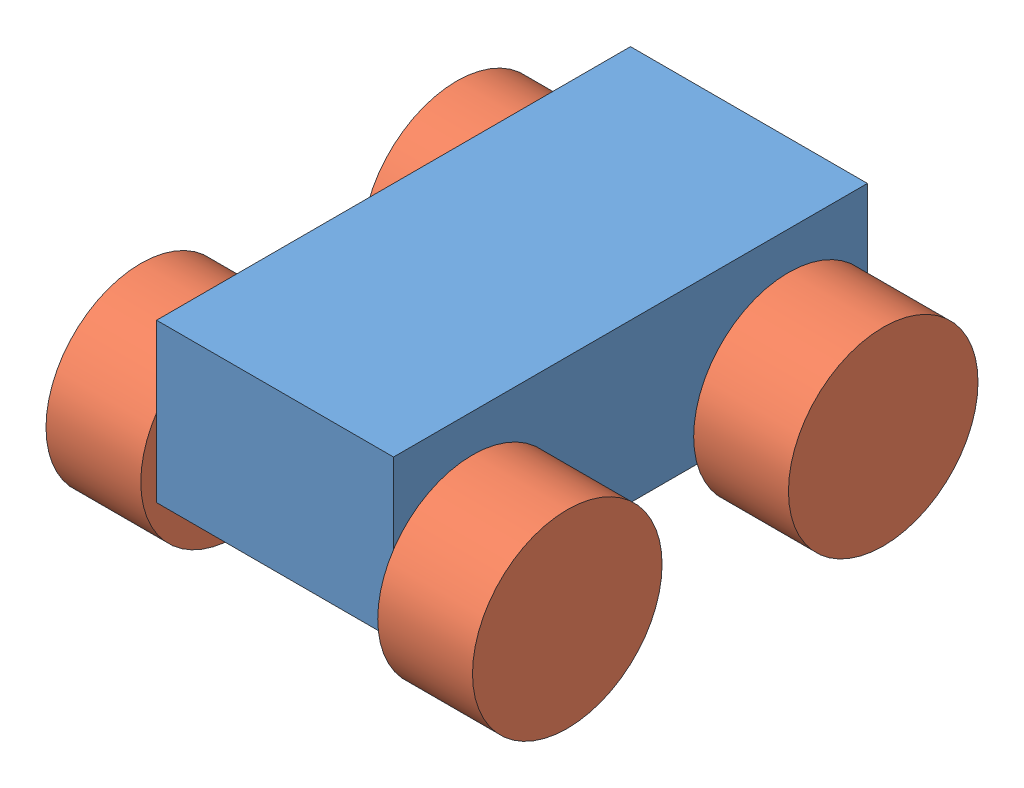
SolidWorks assembly 4_WHEELER.SLDASM, configuration Default (file format 11000). Lengths in mm.
Overall size (175 71.92 160).
5 component instances, 2 part files, 8 mates.
Components (placement in the parent):
- 4_WHEELER_CHASSIS-1: 4_WHEELER_CHASSIS.SLDPRT [Default] at (-14.1165 6.945 -75) size (95 50 150)
- 4_WHEELER_WHEEL-1: 4_WHEELER_WHEEL.SLDPRT [Default] at (-51.6165 -9.9741 -50) x (-1 0 0) z (0 0 -1) size (30 60 60)
- 4_WHEELER_WHEEL-2: 4_WHEELER_WHEEL.SLDPRT [Default] at (-51.6165 -9.9741 50) x (-1 0 0) z (0 0 -1) size (30 60 60)
- 4_WHEELER_WHEEL-3: 4_WHEELER_WHEEL.SLDPRT [Default] at (23.3835 -9.9741 50) size (30 60 60)
- 4_WHEELER_WHEEL-4: 4_WHEELER_WHEEL.SLDPRT [Default] at (23.3835 -9.9741 -50) size (30 60 60)
Mates (geometry in assembly coordinates):
- Concentric1: concentric: cylinder of 4_WHEELER_CHASSIS-1 through (-61.6165 -9.9741 -50) axis (1 0 0) radius 2.3696; cylinder of 4_WHEELER_WHEEL-1 through (-61.6165 -9.9741 -50) axis (1 0 0) radius 2.5
- Concentric2: concentric: cylinder of 4_WHEELER_CHASSIS-1 through (-61.6165 -9.9741 50) axis (1 0 0) radius 2.3696; cylinder of 4_WHEELER_WHEEL-2 through (-61.6165 -9.9741 50) axis (1 0 0) radius 2.5
- Concentric3: concentric: cylinder of 4_WHEELER_CHASSIS-1 through (33.3835 -9.9741 50) axis (-1 0 0) radius 2.3696; cylinder of 4_WHEELER_WHEEL-3 through (33.3835 -9.9741 50) axis (-1 0 0) radius 2.5
- Concentric4: concentric: cylinder of 4_WHEELER_CHASSIS-1 through (33.3835 -9.9741 -50) axis (-1 0 0) radius 2.3696; cylinder of 4_WHEELER_WHEEL-4 through (33.3835 -9.9741 -50) axis (-1 0 0) radius 2.5
- Coincident5: coincident: plane of 4_WHEELER_CHASSIS-1 through (23.3835 31.945 75) normal (1 0 0); circle of 4_WHEELER_WHEEL-3
- Coincident6: coincident: plane of 4_WHEELER_CHASSIS-1 through (23.3835 31.945 75) normal (1 0 0); circle of 4_WHEELER_WHEEL-4
- Coincident7: coincident: plane of 4_WHEELER_CHASSIS-1 through (-51.6165 31.945 75) normal (-1 0 0); circle of 4_WHEELER_WHEEL-1
- Coincident8: coincident: plane of 4_WHEELER_CHASSIS-1 through (-51.6165 31.945 75) normal (-1 0 0); circle of 4_WHEELER_WHEEL-2
